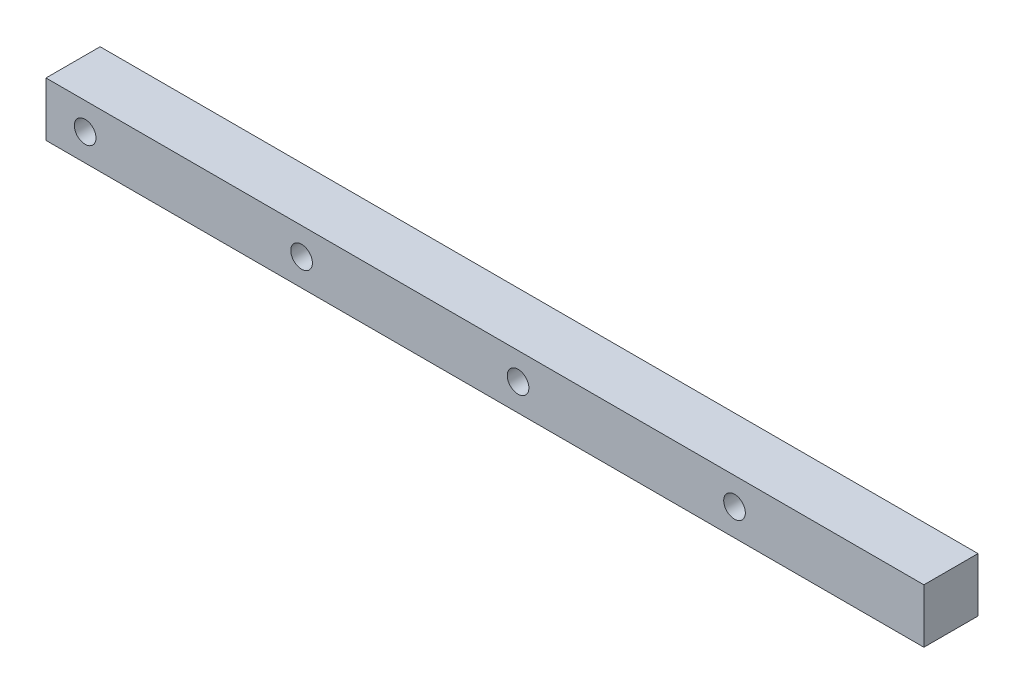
ISO-10303-21;
HEADER;
FILE_DESCRIPTION(('STEP AP214'),'2;1');
FILE_NAME('part.step','',(''),(''),'','','');
FILE_SCHEMA(('AUTOMOTIVE_DESIGN { 1 0 10303 214 1 1 1 1 }'));
ENDSEC;
DATA;
#1=APPLICATION_CONTEXT('core data for automotive mechanical design processes');
#2=APPLICATION_PROTOCOL_DEFINITION('international standard','automotive_design',2000,#1);
#3=PRODUCT_CONTEXT('',#1,'mechanical');
#4=PRODUCT('Part','Part','',(#3));
#5=PRODUCT_RELATED_PRODUCT_CATEGORY('part','',(#4));
#6=PRODUCT_DEFINITION_FORMATION('','',#4);
#7=PRODUCT_DEFINITION_CONTEXT('part definition',#1,'design');
#8=PRODUCT_DEFINITION('design','',#6,#7);
#9=PRODUCT_DEFINITION_SHAPE('','',#8);
#10=(LENGTH_UNIT() NAMED_UNIT(*) SI_UNIT(.MILLI.,.METRE.));
#11=(NAMED_UNIT(*) PLANE_ANGLE_UNIT() SI_UNIT($,.RADIAN.));
#12=(NAMED_UNIT(*) SI_UNIT($,.STERADIAN.) SOLID_ANGLE_UNIT());
#13=UNCERTAINTY_MEASURE_WITH_UNIT(LENGTH_MEASURE(1.E-05),#10,'distance_accuracy_value','');
#14=(GEOMETRIC_REPRESENTATION_CONTEXT(3) GLOBAL_UNCERTAINTY_ASSIGNED_CONTEXT((#13)) GLOBAL_UNIT_ASSIGNED_CONTEXT((#10,
#11,#12)) REPRESENTATION_CONTEXT('',''));
#15=CARTESIAN_POINT('',(0.,0.,0.));
#16=DIRECTION('',(0.,0.,1.));
#17=DIRECTION('',(1.,0.,0.));
#18=AXIS2_PLACEMENT_3D('',#15,#16,#17);
#19=CARTESIAN_POINT('',(127.234179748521,5.,0.));
#20=DIRECTION('',(0.,0.,1.));
#21=DIRECTION('',(1.,0.,0.));
#22=AXIS2_PLACEMENT_3D('',#19,#20,#21);
#23=CYLINDRICAL_SURFACE('',#22,2.);
#24=CARTESIAN_POINT('',(127.234179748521,5.,0.));
#25=DIRECTION('',(0.,0.,1.));
#26=DIRECTION('',(1.,0.,0.));
#27=AXIS2_PLACEMENT_3D('',#24,#25,#26);
#28=CIRCLE('',#27,2.);
#29=CARTESIAN_POINT('',(129.234179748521,5.,0.));
#30=VERTEX_POINT('',#29);
#31=EDGE_CURVE('E48',#30,#30,#28,.T.);
#32=ORIENTED_EDGE('',*,*,#31,.F.);
#33=EDGE_LOOP('',(#32));
#34=FACE_BOUND('',#33,.T.);
#35=CARTESIAN_POINT('',(127.234179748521,5.,10.));
#36=DIRECTION('',(0.,0.,1.));
#37=DIRECTION('',(1.,0.,0.));
#38=AXIS2_PLACEMENT_3D('',#35,#36,#37);
#39=CIRCLE('',#38,2.);
#40=CARTESIAN_POINT('',(129.234179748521,5.,10.));
#41=VERTEX_POINT('',#40);
#42=EDGE_CURVE('E11',#41,#41,#39,.T.);
#43=ORIENTED_EDGE('',*,*,#42,.T.);
#44=EDGE_LOOP('',(#43));
#45=FACE_BOUND('',#44,.T.);
#46=ADVANCED_FACE('F39',(#34,#45),#23,.F.);
#47=CARTESIAN_POINT('',(87.2341797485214,5.,0.));
#48=DIRECTION('',(0.,0.,1.));
#49=DIRECTION('',(1.,0.,0.));
#50=AXIS2_PLACEMENT_3D('',#47,#48,#49);
#51=CYLINDRICAL_SURFACE('',#50,2.);
#52=CARTESIAN_POINT('',(87.2341797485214,5.,0.));
#53=DIRECTION('',(0.,0.,1.));
#54=DIRECTION('',(1.,0.,0.));
#55=AXIS2_PLACEMENT_3D('',#52,#53,#54);
#56=CIRCLE('',#55,2.);
#57=CARTESIAN_POINT('',(89.2341797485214,5.,0.));
#58=VERTEX_POINT('',#57);
#59=EDGE_CURVE('E129',#58,#58,#56,.T.);
#60=ORIENTED_EDGE('',*,*,#59,.F.);
#61=EDGE_LOOP('',(#60));
#62=FACE_BOUND('',#61,.T.);
#63=CARTESIAN_POINT('',(87.2341797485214,5.,10.));
#64=DIRECTION('',(0.,0.,1.));
#65=DIRECTION('',(1.,0.,0.));
#66=AXIS2_PLACEMENT_3D('',#63,#64,#65);
#67=CIRCLE('',#66,2.);
#68=CARTESIAN_POINT('',(89.2341797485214,5.,10.));
#69=VERTEX_POINT('',#68);
#70=EDGE_CURVE('E133',#69,#69,#67,.T.);
#71=ORIENTED_EDGE('',*,*,#70,.T.);
#72=EDGE_LOOP('',(#71));
#73=FACE_BOUND('',#72,.T.);
#74=ADVANCED_FACE('F144',(#62,#73),#51,.F.);
#75=CARTESIAN_POINT('',(0.,0.,10.));
#76=DIRECTION('',(1.,0.,0.));
#77=DIRECTION('',(0.,0.,-1.));
#78=AXIS2_PLACEMENT_3D('',#75,#76,#77);
#79=PLANE('',#78);
#80=DIRECTION('',(0.,-1.,0.));
#81=VECTOR('',#80,1.);
#82=CARTESIAN_POINT('',(0.,0.,0.));
#83=LINE('',#82,#81);
#84=CARTESIAN_POINT('',(0.,10.,0.));
#85=VERTEX_POINT('',#84);
#86=CARTESIAN_POINT('',(0.,0.,0.));
#87=VERTEX_POINT('',#86);
#88=EDGE_CURVE('E112',#85,#87,#83,.T.);
#89=ORIENTED_EDGE('',*,*,#88,.T.);
#90=DIRECTION('',(0.,0.,-1.));
#91=VECTOR('',#90,1.);
#92=CARTESIAN_POINT('',(0.,0.,10.));
#93=LINE('',#92,#91);
#94=CARTESIAN_POINT('',(0.,0.,10.));
#95=VERTEX_POINT('',#94);
#96=EDGE_CURVE('E101',#95,#87,#93,.T.);
#97=ORIENTED_EDGE('',*,*,#96,.F.);
#98=DIRECTION('',(0.,-1.,0.));
#99=VECTOR('',#98,1.);
#100=CARTESIAN_POINT('',(0.,0.,10.));
#101=LINE('',#100,#99);
#102=CARTESIAN_POINT('',(0.,10.,10.));
#103=VERTEX_POINT('',#102);
#104=EDGE_CURVE('E93',#103,#95,#101,.T.);
#105=ORIENTED_EDGE('',*,*,#104,.F.);
#106=DIRECTION('',(0.,0.,-1.));
#107=VECTOR('',#106,1.);
#108=CARTESIAN_POINT('',(0.,10.,10.));
#109=LINE('',#108,#107);
#110=EDGE_CURVE('E108',#103,#85,#109,.T.);
#111=ORIENTED_EDGE('',*,*,#110,.T.);
#112=EDGE_LOOP('',(#89,#97,#105,#111));
#113=FACE_BOUND('',#112,.T.);
#114=ADVANCED_FACE('F168',(#113),#79,.F.);
#115=CARTESIAN_POINT('',(0.,0.,10.));
#116=DIRECTION('',(0.,1.,0.));
#117=DIRECTION('',(0.,0.,1.));
#118=AXIS2_PLACEMENT_3D('',#115,#116,#117);
#119=PLANE('',#118);
#120=DIRECTION('',(1.,0.,0.));
#121=VECTOR('',#120,1.);
#122=CARTESIAN_POINT('',(0.,0.,0.));
#123=LINE('',#122,#121);
#124=CARTESIAN_POINT('',(162.23,0.,0.));
#125=VERTEX_POINT('',#124);
#126=EDGE_CURVE('E99',#87,#125,#123,.T.);
#127=ORIENTED_EDGE('',*,*,#126,.T.);
#128=DIRECTION('',(0.,0.,-1.));
#129=VECTOR('',#128,1.);
#130=CARTESIAN_POINT('',(162.23,0.,10.));
#131=LINE('',#130,#129);
#132=CARTESIAN_POINT('',(162.23,0.,10.));
#133=VERTEX_POINT('',#132);
#134=EDGE_CURVE('E97',#133,#125,#131,.T.);
#135=ORIENTED_EDGE('',*,*,#134,.F.);
#136=DIRECTION('',(1.,0.,0.));
#137=VECTOR('',#136,1.);
#138=CARTESIAN_POINT('',(0.,0.,10.));
#139=LINE('',#138,#137);
#140=EDGE_CURVE('E87',#95,#133,#139,.T.);
#141=ORIENTED_EDGE('',*,*,#140,.F.);
#142=ORIENTED_EDGE('',*,*,#96,.T.);
#143=EDGE_LOOP('',(#127,#135,#141,#142));
#144=FACE_BOUND('',#143,.T.);
#145=ADVANCED_FACE('F98',(#144),#119,.F.);
#146=CARTESIAN_POINT('',(162.23,0.,10.));
#147=DIRECTION('',(-1.,0.,0.));
#148=DIRECTION('',(0.,0.,1.));
#149=AXIS2_PLACEMENT_3D('',#146,#147,#148);
#150=PLANE('',#149);
#151=DIRECTION('',(0.,1.,0.));
#152=VECTOR('',#151,1.);
#153=CARTESIAN_POINT('',(162.23,0.,0.));
#154=LINE('',#153,#152);
#155=CARTESIAN_POINT('',(162.23,10.,0.));
#156=VERTEX_POINT('',#155);
#157=EDGE_CURVE('E73',#125,#156,#154,.T.);
#158=ORIENTED_EDGE('',*,*,#157,.T.);
#159=DIRECTION('',(0.,0.,-1.));
#160=VECTOR('',#159,1.);
#161=CARTESIAN_POINT('',(162.23,10.,10.));
#162=LINE('',#161,#160);
#163=CARTESIAN_POINT('',(162.23,10.,10.));
#164=VERTEX_POINT('',#163);
#165=EDGE_CURVE('E102',#164,#156,#162,.T.);
#166=ORIENTED_EDGE('',*,*,#165,.F.);
#167=DIRECTION('',(0.,1.,0.));
#168=VECTOR('',#167,1.);
#169=CARTESIAN_POINT('',(162.23,0.,10.));
#170=LINE('',#169,#168);
#171=EDGE_CURVE('E91',#133,#164,#170,.T.);
#172=ORIENTED_EDGE('',*,*,#171,.F.);
#173=ORIENTED_EDGE('',*,*,#134,.T.);
#174=EDGE_LOOP('',(#158,#166,#172,#173));
#175=FACE_BOUND('',#174,.T.);
#176=ADVANCED_FACE('F104',(#175),#150,.F.);
#177=CARTESIAN_POINT('',(0.,10.,10.));
#178=DIRECTION('',(0.,-1.,0.));
#179=DIRECTION('',(0.,0.,-1.));
#180=AXIS2_PLACEMENT_3D('',#177,#178,#179);
#181=PLANE('',#180);
#182=DIRECTION('',(-1.,0.,0.));
#183=VECTOR('',#182,1.);
#184=CARTESIAN_POINT('',(0.,10.,0.));
#185=LINE('',#184,#183);
#186=EDGE_CURVE('E79',#156,#85,#185,.T.);
#187=ORIENTED_EDGE('',*,*,#186,.T.);
#188=ORIENTED_EDGE('',*,*,#110,.F.);
#189=DIRECTION('',(-1.,0.,0.));
#190=VECTOR('',#189,1.);
#191=CARTESIAN_POINT('',(0.,10.,10.));
#192=LINE('',#191,#190);
#193=EDGE_CURVE('E56',#164,#103,#192,.T.);
#194=ORIENTED_EDGE('',*,*,#193,.F.);
#195=ORIENTED_EDGE('',*,*,#165,.T.);
#196=EDGE_LOOP('',(#187,#188,#194,#195));
#197=FACE_BOUND('',#196,.T.);
#198=ADVANCED_FACE('F148',(#197),#181,.F.);
#199=CARTESIAN_POINT('',(0.,0.,10.));
#200=DIRECTION('',(0.,0.,-1.));
#201=DIRECTION('',(-1.,0.,0.));
#202=AXIS2_PLACEMENT_3D('',#199,#200,#201);
#203=PLANE('',#202);
#204=CARTESIAN_POINT('',(47.2341797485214,5.,10.));
#205=DIRECTION('',(0.,0.,1.));
#206=DIRECTION('',(1.,0.,0.));
#207=AXIS2_PLACEMENT_3D('',#204,#205,#206);
#208=CIRCLE('',#207,2.);
#209=CARTESIAN_POINT('',(49.2341797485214,5.,10.));
#210=VERTEX_POINT('',#209);
#211=EDGE_CURVE('E239',#210,#210,#208,.T.);
#212=ORIENTED_EDGE('',*,*,#211,.F.);
#213=EDGE_LOOP('',(#212));
#214=FACE_BOUND('',#213,.T.);
#215=CARTESIAN_POINT('',(7.23417974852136,5.,10.));
#216=DIRECTION('',(0.,0.,1.));
#217=DIRECTION('',(1.,0.,0.));
#218=AXIS2_PLACEMENT_3D('',#215,#216,#217);
#219=CIRCLE('',#218,2.);
#220=CARTESIAN_POINT('',(9.23417974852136,5.,10.));
#221=VERTEX_POINT('',#220);
#222=EDGE_CURVE('E241',#221,#221,#219,.T.);
#223=ORIENTED_EDGE('',*,*,#222,.F.);
#224=EDGE_LOOP('',(#223));
#225=FACE_BOUND('',#224,.T.);
#226=ORIENTED_EDGE('',*,*,#104,.T.);
#227=ORIENTED_EDGE('',*,*,#140,.T.);
#228=ORIENTED_EDGE('',*,*,#171,.T.);
#229=ORIENTED_EDGE('',*,*,#193,.T.);
#230=EDGE_LOOP('',(#226,#227,#228,#229));
#231=FACE_BOUND('',#230,.T.);
#232=ORIENTED_EDGE('',*,*,#70,.F.);
#233=EDGE_LOOP('',(#232));
#234=FACE_BOUND('',#233,.T.);
#235=ORIENTED_EDGE('',*,*,#42,.F.);
#236=EDGE_LOOP('',(#235));
#237=FACE_BOUND('',#236,.T.);
#238=ADVANCED_FACE('F88',(#214,#225,#231,#234,#237),#203,.F.);
#239=CARTESIAN_POINT('',(0.,0.,0.));
#240=DIRECTION('',(0.,0.,-1.));
#241=DIRECTION('',(-1.,0.,0.));
#242=AXIS2_PLACEMENT_3D('',#239,#240,#241);
#243=PLANE('',#242);
#244=CARTESIAN_POINT('',(47.2341797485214,5.,0.));
#245=DIRECTION('',(0.,0.,1.));
#246=DIRECTION('',(1.,0.,0.));
#247=AXIS2_PLACEMENT_3D('',#244,#245,#246);
#248=CIRCLE('',#247,2.);
#249=CARTESIAN_POINT('',(49.2341797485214,5.,0.));
#250=VERTEX_POINT('',#249);
#251=EDGE_CURVE('E237',#250,#250,#248,.T.);
#252=ORIENTED_EDGE('',*,*,#251,.T.);
#253=EDGE_LOOP('',(#252));
#254=FACE_BOUND('',#253,.T.);
#255=CARTESIAN_POINT('',(7.23417974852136,5.,0.));
#256=DIRECTION('',(0.,0.,1.));
#257=DIRECTION('',(1.,0.,0.));
#258=AXIS2_PLACEMENT_3D('',#255,#256,#257);
#259=CIRCLE('',#258,2.);
#260=CARTESIAN_POINT('',(9.23417974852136,5.,0.));
#261=VERTEX_POINT('',#260);
#262=EDGE_CURVE('E116',#261,#261,#259,.T.);
#263=ORIENTED_EDGE('',*,*,#262,.T.);
#264=EDGE_LOOP('',(#263));
#265=FACE_BOUND('',#264,.T.);
#266=ORIENTED_EDGE('',*,*,#88,.F.);
#267=ORIENTED_EDGE('',*,*,#186,.F.);
#268=ORIENTED_EDGE('',*,*,#157,.F.);
#269=ORIENTED_EDGE('',*,*,#126,.F.);
#270=EDGE_LOOP('',(#266,#267,#268,#269));
#271=FACE_BOUND('',#270,.T.);
#272=ORIENTED_EDGE('',*,*,#59,.T.);
#273=EDGE_LOOP('',(#272));
#274=FACE_BOUND('',#273,.T.);
#275=ORIENTED_EDGE('',*,*,#31,.T.);
#276=EDGE_LOOP('',(#275));
#277=FACE_BOUND('',#276,.T.);
#278=ADVANCED_FACE('F140',(#254,#265,#271,#274,#277),#243,.T.);
#279=CARTESIAN_POINT('',(7.23417974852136,5.,0.));
#280=DIRECTION('',(0.,0.,1.));
#281=DIRECTION('',(1.,0.,0.));
#282=AXIS2_PLACEMENT_3D('',#279,#280,#281);
#283=CYLINDRICAL_SURFACE('',#282,2.);
#284=ORIENTED_EDGE('',*,*,#262,.F.);
#285=EDGE_LOOP('',(#284));
#286=FACE_BOUND('',#285,.T.);
#287=ORIENTED_EDGE('',*,*,#222,.T.);
#288=EDGE_LOOP('',(#287));
#289=FACE_BOUND('',#288,.T.);
#290=ADVANCED_FACE('F155',(#286,#289),#283,.F.);
#291=CARTESIAN_POINT('',(47.2341797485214,5.,0.));
#292=DIRECTION('',(0.,0.,1.));
#293=DIRECTION('',(1.,0.,0.));
#294=AXIS2_PLACEMENT_3D('',#291,#292,#293);
#295=CYLINDRICAL_SURFACE('',#294,2.);
#296=ORIENTED_EDGE('',*,*,#251,.F.);
#297=EDGE_LOOP('',(#296));
#298=FACE_BOUND('',#297,.T.);
#299=ORIENTED_EDGE('',*,*,#211,.T.);
#300=EDGE_LOOP('',(#299));
#301=FACE_BOUND('',#300,.T.);
#302=ADVANCED_FACE('F206',(#298,#301),#295,.F.);
#303=CLOSED_SHELL('',(#46,#74,#114,#145,#176,#198,#238,#278,#290,#302));
#304=MANIFOLD_SOLID_BREP('B2',#303);
#305=ADVANCED_BREP_SHAPE_REPRESENTATION('',(#18,#304),#14);
#306=SHAPE_DEFINITION_REPRESENTATION(#9,#305);
ENDSEC;
END-ISO-10303-21;
